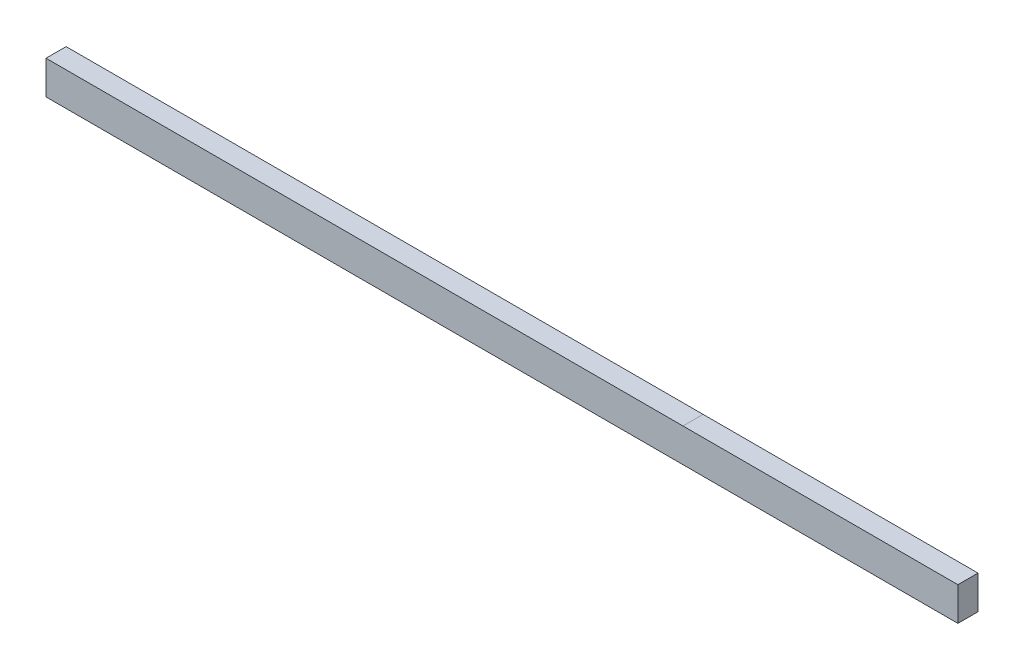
from build123d import *

# Parameters (mm, degrees)
SKETCH1_W      = 15
SKETCH1_H      = 25
EXTRUDE1_DEPTH = 680


with BuildPart() as part:
    # Sketch1 → Extrude1 (new body)
    with BuildSketch(Plane(origin=(0, 0, 0), x_dir=(0, 0, -1), z_dir=(1, 0, 0))):
        Rectangle(SKETCH1_W, SKETCH1_H)
    extrude(amount=EXTRUDE1_DEPTH)


solid = part.part
